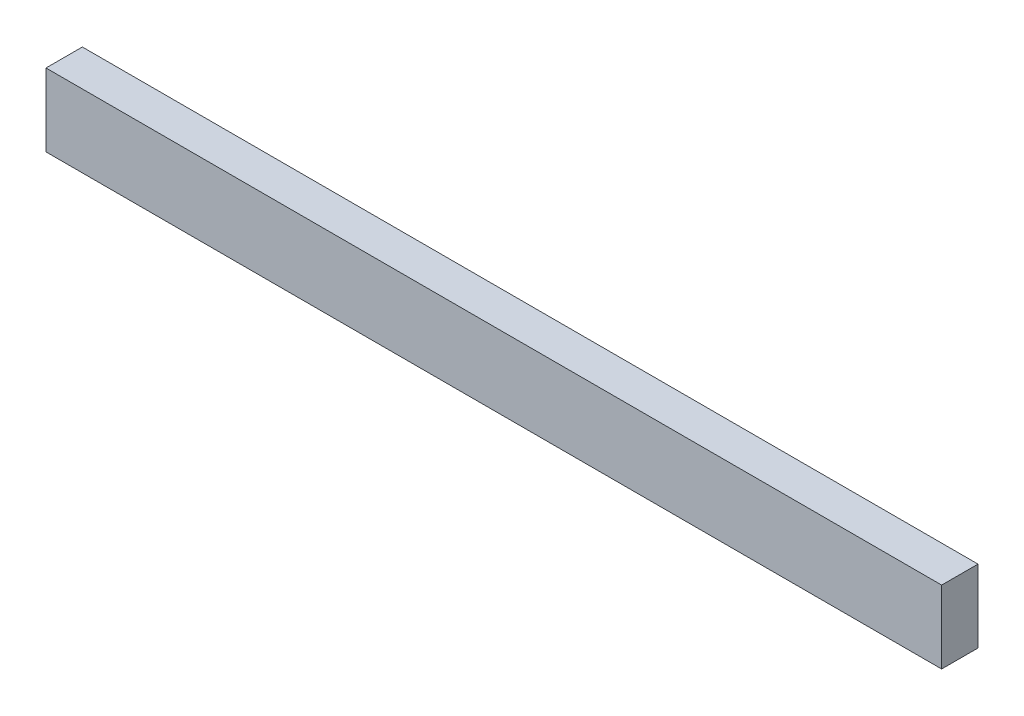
from build123d import *

# Parameters (mm, degrees)
SKETCH1_W           = 24.64
SKETCH1_H           = 2
BOSS_EXTRUDE1_DEPTH = 1


with BuildPart() as part:
    # Sketch1 → Boss-Extrude1 (new body)
    with BuildSketch(Plane.XY):
        with Locations((-0.804879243, -2.668622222)):
            Rectangle(SKETCH1_W, SKETCH1_H)
    extrude(amount=BOSS_EXTRUDE1_DEPTH)


solid = part.part
